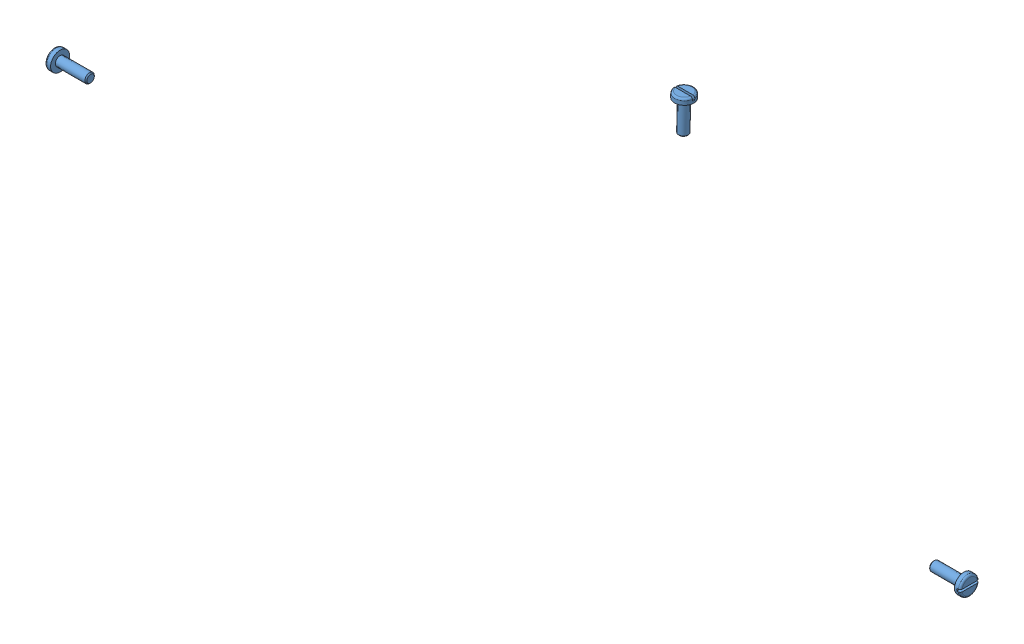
SolidWorks assembly L8570_Assemblage_complet.SLDASM, configuration Défaut (file format 3100). Lengths in mm.
Overall size (240.63 39.77 45.03).
5 component instances, 1 part files, 10 mates.
Components (placement in the parent):
- Lu1_Assemblage-1: Lu1_Assemblage.SLDASM [Défaut] at (-13.6612 37.3701 62.2853) (suppressed, hidden)
- Lu1_Plaque_support_équipée-1: Lu1_Plaque_support_équipée.SLDASM [Défaut] at (-18.9185 22.7004 62.2853) x (-1 0 0) z (0 0 -1) (suppressed, hidden)
- Lu1_VisCLS4-2: Lu1_VisCLS4.SLDPRT [Défaut] at (-18.9185 21.7531 64.3108) x (1 0 0) z (0 -0.999657 0.026177) size (5.02 5 9.53)
- Lu1_VisCLS4-3: Lu1_VisCLS4.SLDPRT [Défaut] at (93.6193 -12.9044 103.2853) x (0 0 1) z (-1 0 0) size (5.02 5 9.53)
- Lu1_VisCLS4-4: Lu1_VisCLS4.SLDPRT [Défaut] at (-143.9495 -12.9044 103.2853) x (0 0.786061 -0.61815) z (1 0 0) size (5.02 5 9.53)
Mates (geometry in assembly coordinates):
- Parallèle1: parallel anti-aligned: line of ?; line of Lu1_Plaque_support_équipée-1
- Coïncidente4: coincident: plane of ? through (90.0815 -46.4044 62.2853) normal (0 0 -1); line of Lu1_Plaque_support_équipée-1
- Coïncidente7: coincident: plane of ? through (92.0815 22.5956 58.2853) normal (0 0.999657 -0.026177); line of Lu1_Plaque_support_équipée-1
- Distance1: distance = 0.5 mm: line of ?; line of Lu1_Plaque_support_équipée-1
- Coaxiale1: concentric anti-aligned: circle of ? centre (-18.9185 22.7527 64.2846) axis (0 0.999657 -0.026177); cylinder of Lu1_VisCLS4-2
- Coïncidente9: coincident aligned: plane of ? through (92.0815 22.5956 58.2853) normal (0 0.999657 -0.026177); circle of Lu1_VisCLS4-2 centre (-18.9185 22.7527 64.2846) axis (0 0.999657 -0.026177)
- Coaxiale2: concentric anti-aligned: cylinder of ?; cylinder of Lu1_VisCLS4-4
- Coïncidente11: coincident: plane of ? through (-144.1651 26.8422 93.7853) normal (-0.999743 0 0.022687); point of Lu1_VisCLS4-4
- Coaxiale3: concentric anti-aligned: cylinder of ?; cylinder of Lu1_VisCLS4-3
- Coïncidente12: coincident: plane of ? through (93.8349 26.8422 93.7853) normal (0.999743 0 0.022687); point of Lu1_VisCLS4-3
